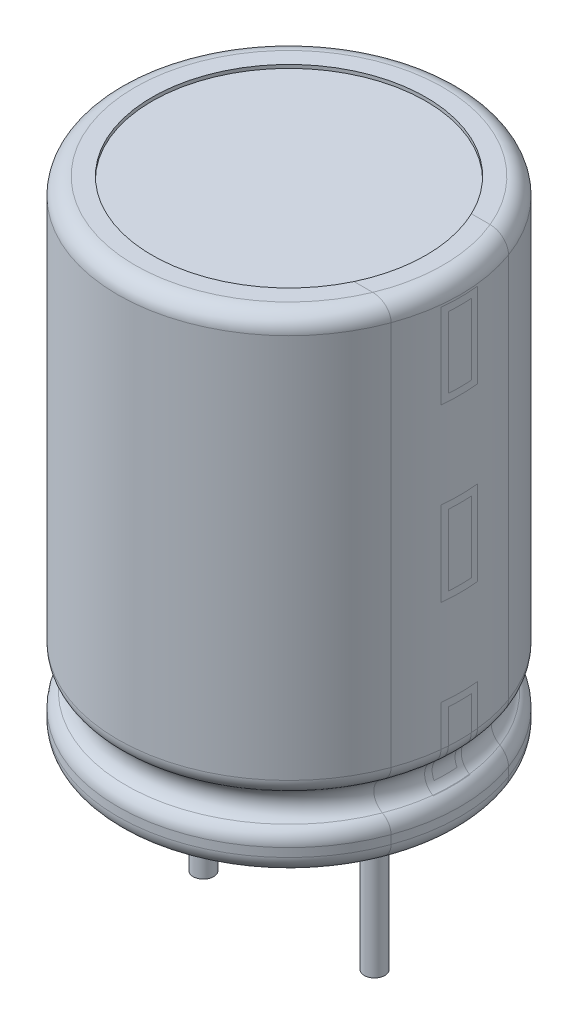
from build123d import *

# Parameters (mm, degrees)
SKETCH1_R             = 0.3
BOSS_EXTRUDE1_DEPTH   = 4.72
BOSS_EXTRUDE1_2_DEPTH = 4.72


with BuildPart() as part:
    # Sketch1 → Boss-Extrude1 (new body)
    with BuildSketch(Plane(origin=(0, 0, 0), x_dir=(1, 0, 0), z_dir=(0, 1, 0))):
        with Locations(Location((-2.5, 0, 0), (0, 0, 270))):
            Circle(SKETCH1_R)
    extrude(amount=-BOSS_EXTRUDE1_DEPTH)



with BuildPart() as body_2:
    # Sketch1 → Boss-Extrude1 2 (new body)
    with BuildSketch(Plane(origin=(0, 0, 0), x_dir=(1, 0, 0), z_dir=(0, 1, 0))):
        with Locations(Location((2.5, 0, 0), (0, 0, 90))):
            Circle(SKETCH1_R)
    extrude(amount=-BOSS_EXTRUDE1_2_DEPTH)


with BuildPart() as part_1:
    add(part.part)

    add(body_2.part)  # Revolve1 merges body 2
    # Sketch3 → Revolve1 (revolve)
    with BuildSketch(Plane.XY):
        with BuildLine():
            Line((5, 0.4), (5, 0.650521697))
            ThreePointArc((5, 0.650521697), (4.937148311, 0.893217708), (4.764394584, 1.074898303))
            ThreePointArc((4.764394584, 1.074898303), (4.528386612, 1.5), (4.764394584, 1.925101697))
            ThreePointArc((4.764394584, 1.925101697), (4.937148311, 2.106782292), (5, 2.349478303))
            Line((5, 2.349478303), (5, 13.6))
            ThreePointArc((5, 13.6), (4.853553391, 13.953553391), (4.5, 14.1))
            Line((4.5, 14.1), (4, 14.1))
            Line((4, 14.1), (4, 14))
            Line((4, 14), (0, 14))
            Line((0, 14), (0, 0))
            Line((0, 0), (4, 0))
            Line((4, 0), (4, -0.1))
            Line((4, -0.1), (4.5, -0.1))
            ThreePointArc((4.5, -0.1), (4.853553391, 0.046446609), (5, 0.4))
        make_face()
    revolve(axis=Axis((0, 0, 0), (0, 1, 0)))


solid = part_1.part
